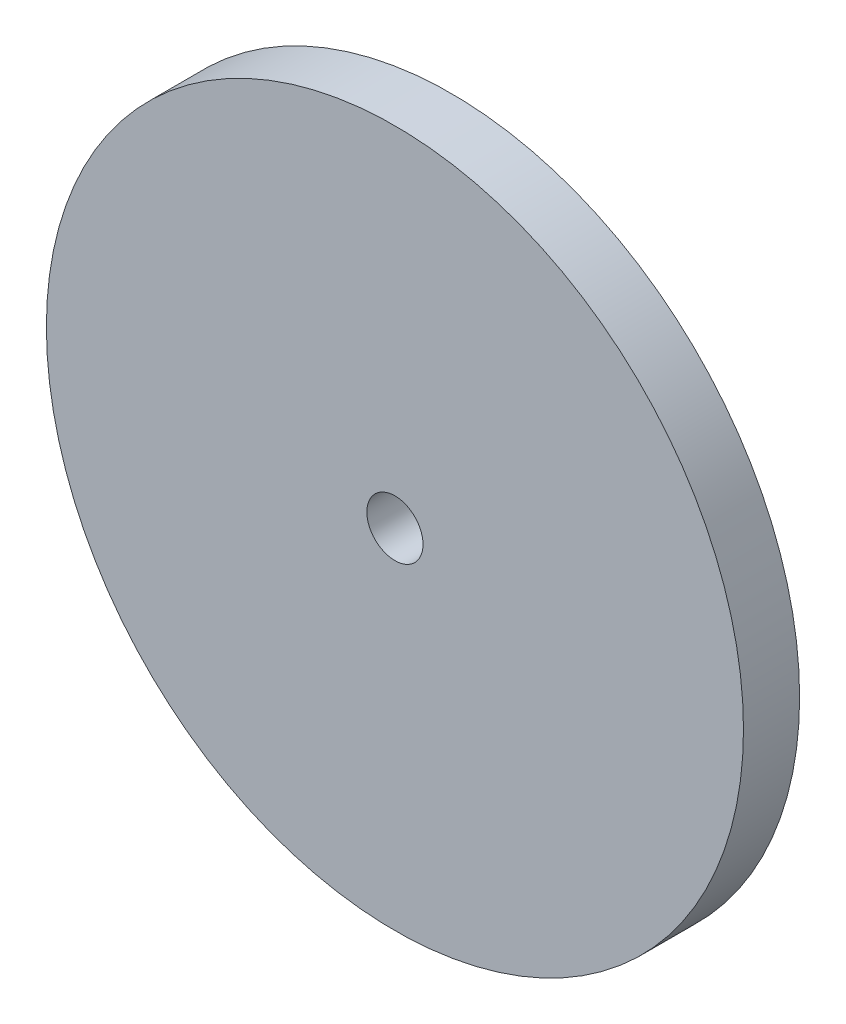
ISO-10303-21;
HEADER;
FILE_DESCRIPTION(('STEP AP214'),'2;1');
FILE_NAME('part.step','',(''),(''),'','','');
FILE_SCHEMA(('AUTOMOTIVE_DESIGN { 1 0 10303 214 1 1 1 1 }'));
ENDSEC;
DATA;
#1=APPLICATION_CONTEXT('core data for automotive mechanical design processes');
#2=APPLICATION_PROTOCOL_DEFINITION('international standard','automotive_design',2000,#1);
#3=PRODUCT_CONTEXT('',#1,'mechanical');
#4=PRODUCT('Part','Part','',(#3));
#5=PRODUCT_RELATED_PRODUCT_CATEGORY('part','',(#4));
#6=PRODUCT_DEFINITION_FORMATION('','',#4);
#7=PRODUCT_DEFINITION_CONTEXT('part definition',#1,'design');
#8=PRODUCT_DEFINITION('design','',#6,#7);
#9=PRODUCT_DEFINITION_SHAPE('','',#8);
#10=(LENGTH_UNIT() NAMED_UNIT(*) SI_UNIT(.MILLI.,.METRE.));
#11=(NAMED_UNIT(*) PLANE_ANGLE_UNIT() SI_UNIT($,.RADIAN.));
#12=(NAMED_UNIT(*) SI_UNIT($,.STERADIAN.) SOLID_ANGLE_UNIT());
#13=UNCERTAINTY_MEASURE_WITH_UNIT(LENGTH_MEASURE(1.E-05),#10,'distance_accuracy_value','');
#14=(GEOMETRIC_REPRESENTATION_CONTEXT(3) GLOBAL_UNCERTAINTY_ASSIGNED_CONTEXT((#13)) GLOBAL_UNIT_ASSIGNED_CONTEXT((#10,
#11,#12)) REPRESENTATION_CONTEXT('',''));
#15=CARTESIAN_POINT('',(0.,0.,0.));
#16=DIRECTION('',(0.,0.,1.));
#17=DIRECTION('',(1.,0.,0.));
#18=AXIS2_PLACEMENT_3D('',#15,#16,#17);
#19=CARTESIAN_POINT('',(22.,97.,62.5));
#20=DIRECTION('',(0.,0.,1.));
#21=DIRECTION('',(1.,0.,0.));
#22=AXIS2_PLACEMENT_3D('',#19,#20,#21);
#23=PLANE('',#22);
#24=CARTESIAN_POINT('',(22.,97.,62.5));
#25=DIRECTION('',(0.,0.,1.));
#26=DIRECTION('',(1.,0.,0.));
#27=AXIS2_PLACEMENT_3D('',#24,#25,#26);
#28=CIRCLE('',#27,74.5);
#29=CARTESIAN_POINT('',(96.5,97.,62.5));
#30=VERTEX_POINT('',#29);
#31=EDGE_CURVE('E10',#30,#30,#28,.T.);
#32=ORIENTED_EDGE('',*,*,#31,.T.);
#33=EDGE_LOOP('',(#32));
#34=FACE_BOUND('',#33,.T.);
#35=CARTESIAN_POINT('',(22.,97.,62.5));
#36=DIRECTION('',(0.,0.,1.));
#37=DIRECTION('',(1.,0.,0.));
#38=AXIS2_PLACEMENT_3D('',#35,#36,#37);
#39=CIRCLE('',#38,6.);
#40=CARTESIAN_POINT('',(28.,97.,62.5));
#41=VERTEX_POINT('',#40);
#42=EDGE_CURVE('E42',#41,#41,#39,.T.);
#43=ORIENTED_EDGE('',*,*,#42,.F.);
#44=EDGE_LOOP('',(#43));
#45=FACE_BOUND('',#44,.T.);
#46=ADVANCED_FACE('F31',(#34,#45),#23,.T.);
#47=CARTESIAN_POINT('',(22.,97.,50.5));
#48=DIRECTION('',(0.,0.,1.));
#49=DIRECTION('',(1.,0.,0.));
#50=AXIS2_PLACEMENT_3D('',#47,#48,#49);
#51=PLANE('',#50);
#52=CARTESIAN_POINT('',(22.,97.,50.5));
#53=DIRECTION('',(0.,0.,1.));
#54=DIRECTION('',(1.,0.,0.));
#55=AXIS2_PLACEMENT_3D('',#52,#53,#54);
#56=CIRCLE('',#55,74.5);
#57=CARTESIAN_POINT('',(96.5,97.,50.5));
#58=VERTEX_POINT('',#57);
#59=EDGE_CURVE('E35',#58,#58,#56,.T.);
#60=ORIENTED_EDGE('',*,*,#59,.F.);
#61=EDGE_LOOP('',(#60));
#62=FACE_BOUND('',#61,.T.);
#63=CARTESIAN_POINT('',(22.,97.,50.5));
#64=DIRECTION('',(0.,0.,1.));
#65=DIRECTION('',(1.,0.,0.));
#66=AXIS2_PLACEMENT_3D('',#63,#64,#65);
#67=CIRCLE('',#66,6.);
#68=CARTESIAN_POINT('',(28.,97.,50.5));
#69=VERTEX_POINT('',#68);
#70=EDGE_CURVE('E44',#69,#69,#67,.T.);
#71=ORIENTED_EDGE('',*,*,#70,.T.);
#72=EDGE_LOOP('',(#71));
#73=FACE_BOUND('',#72,.T.);
#74=ADVANCED_FACE('F54',(#62,#73),#51,.F.);
#75=CARTESIAN_POINT('',(22.,97.,62.5));
#76=DIRECTION('',(0.,0.,-1.));
#77=DIRECTION('',(-1.,0.,0.));
#78=AXIS2_PLACEMENT_3D('',#75,#76,#77);
#79=CYLINDRICAL_SURFACE('',#78,74.5);
#80=ORIENTED_EDGE('',*,*,#31,.F.);
#81=EDGE_LOOP('',(#80));
#82=FACE_BOUND('',#81,.T.);
#83=ORIENTED_EDGE('',*,*,#59,.T.);
#84=EDGE_LOOP('',(#83));
#85=FACE_BOUND('',#84,.T.);
#86=ADVANCED_FACE('F33',(#82,#85),#79,.T.);
#87=CARTESIAN_POINT('',(22.,97.,62.5));
#88=DIRECTION('',(0.,0.,-1.));
#89=DIRECTION('',(-1.,0.,0.));
#90=AXIS2_PLACEMENT_3D('',#87,#88,#89);
#91=CYLINDRICAL_SURFACE('',#90,6.);
#92=ORIENTED_EDGE('',*,*,#42,.T.);
#93=EDGE_LOOP('',(#92));
#94=FACE_BOUND('',#93,.T.);
#95=ORIENTED_EDGE('',*,*,#70,.F.);
#96=EDGE_LOOP('',(#95));
#97=FACE_BOUND('',#96,.T.);
#98=ADVANCED_FACE('F50',(#94,#97),#91,.F.);
#99=CLOSED_SHELL('',(#46,#74,#86,#98));
#100=MANIFOLD_SOLID_BREP('B2',#99);
#101=ADVANCED_BREP_SHAPE_REPRESENTATION('',(#18,#100),#14);
#102=SHAPE_DEFINITION_REPRESENTATION(#9,#101);
ENDSEC;
END-ISO-10303-21;
